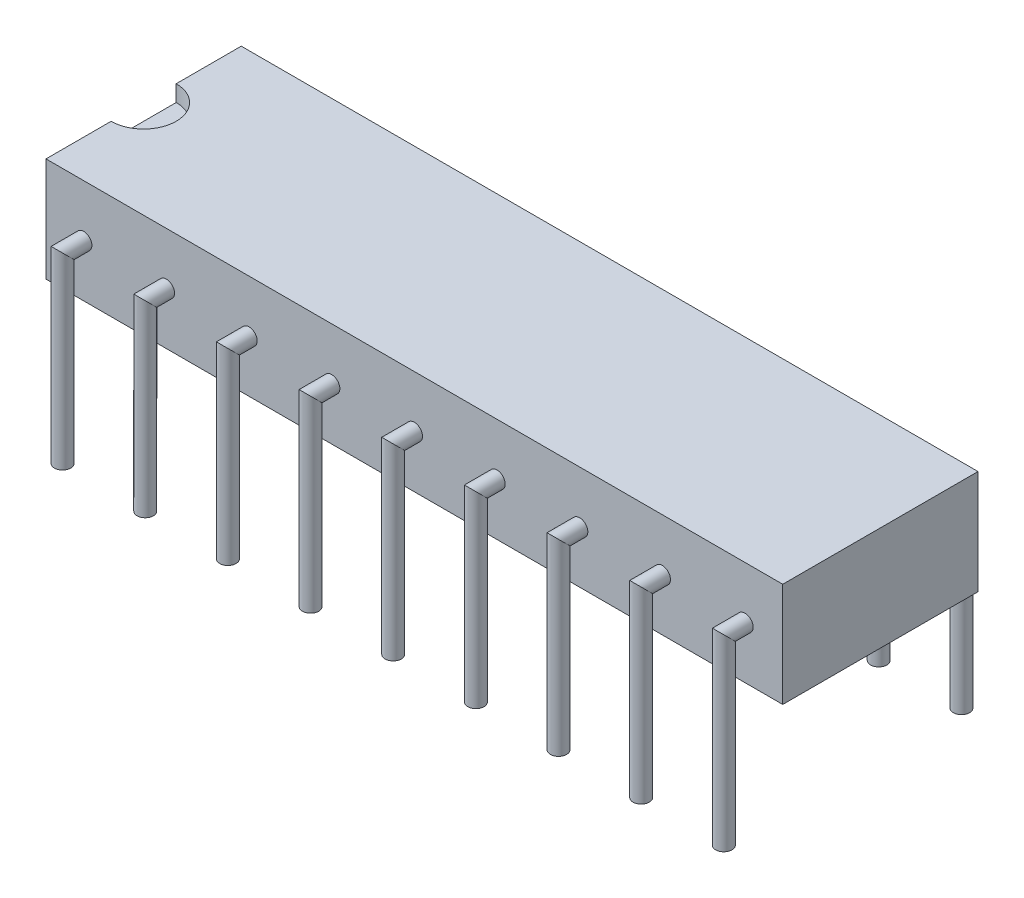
ISO-10303-21;
HEADER;
FILE_DESCRIPTION(('STEP AP214'),'2;1');
FILE_NAME('part.step','',(''),(''),'','','');
FILE_SCHEMA(('AUTOMOTIVE_DESIGN { 1 0 10303 214 1 1 1 1 }'));
ENDSEC;
DATA;
#1=APPLICATION_CONTEXT('core data for automotive mechanical design processes');
#2=APPLICATION_PROTOCOL_DEFINITION('international standard','automotive_design',2000,#1);
#3=PRODUCT_CONTEXT('',#1,'mechanical');
#4=PRODUCT('Part','Part','',(#3));
#5=PRODUCT_RELATED_PRODUCT_CATEGORY('part','',(#4));
#6=PRODUCT_DEFINITION_FORMATION('','',#4);
#7=PRODUCT_DEFINITION_CONTEXT('part definition',#1,'design');
#8=PRODUCT_DEFINITION('design','',#6,#7);
#9=PRODUCT_DEFINITION_SHAPE('','',#8);
#10=(LENGTH_UNIT() NAMED_UNIT(*) SI_UNIT(.MILLI.,.METRE.));
#11=(NAMED_UNIT(*) PLANE_ANGLE_UNIT() SI_UNIT($,.RADIAN.));
#12=(NAMED_UNIT(*) SI_UNIT($,.STERADIAN.) SOLID_ANGLE_UNIT());
#13=UNCERTAINTY_MEASURE_WITH_UNIT(LENGTH_MEASURE(1.E-05),#10,'distance_accuracy_value','');
#14=(GEOMETRIC_REPRESENTATION_CONTEXT(3) GLOBAL_UNCERTAINTY_ASSIGNED_CONTEXT((#13)) GLOBAL_UNIT_ASSIGNED_CONTEXT((#10,
#11,#12)) REPRESENTATION_CONTEXT('',''));
#15=CARTESIAN_POINT('',(0.,0.,0.));
#16=DIRECTION('',(0.,0.,1.));
#17=DIRECTION('',(1.,0.,0.));
#18=AXIS2_PLACEMENT_3D('',#15,#16,#17);
#19=CARTESIAN_POINT('',(22.64,3.2,3.));
#20=DIRECTION('',(0.,0.,-1.));
#21=DIRECTION('',(-1.,0.,0.));
#22=AXIS2_PLACEMENT_3D('',#19,#20,#21);
#23=PLANE('',#22);
#24=CARTESIAN_POINT('',(18.94,1.6,3.));
#25=DIRECTION('',(0.,0.,-1.));
#26=DIRECTION('',(-1.,0.,0.));
#27=AXIS2_PLACEMENT_3D('',#24,#25,#26);
#28=CIRCLE('',#27,0.25);
#29=CARTESIAN_POINT('',(18.69,1.6,3.));
#30=VERTEX_POINT('',#29);
#31=EDGE_CURVE('E62',#30,#30,#28,.F.);
#32=ORIENTED_EDGE('',*,*,#31,.F.);
#33=EDGE_LOOP('',(#32));
#34=FACE_BOUND('',#33,.T.);
#35=CARTESIAN_POINT('',(13.86,1.6,3.));
#36=DIRECTION('',(0.,0.,-1.));
#37=DIRECTION('',(-1.,0.,0.));
#38=AXIS2_PLACEMENT_3D('',#35,#36,#37);
#39=CIRCLE('',#38,0.25);
#40=CARTESIAN_POINT('',(13.61,1.6,3.));
#41=VERTEX_POINT('',#40);
#42=EDGE_CURVE('E168',#41,#41,#39,.F.);
#43=ORIENTED_EDGE('',*,*,#42,.F.);
#44=EDGE_LOOP('',(#43));
#45=FACE_BOUND('',#44,.T.);
#46=CARTESIAN_POINT('',(8.78,1.6,3.));
#47=DIRECTION('',(0.,0.,-1.));
#48=DIRECTION('',(-1.,0.,0.));
#49=AXIS2_PLACEMENT_3D('',#46,#47,#48);
#50=CIRCLE('',#49,0.25);
#51=CARTESIAN_POINT('',(8.53,1.6,3.));
#52=VERTEX_POINT('',#51);
#53=EDGE_CURVE('E162',#52,#52,#50,.F.);
#54=ORIENTED_EDGE('',*,*,#53,.F.);
#55=EDGE_LOOP('',(#54));
#56=FACE_BOUND('',#55,.T.);
#57=CARTESIAN_POINT('',(3.7,1.6,3.));
#58=DIRECTION('',(0.,0.,-1.));
#59=DIRECTION('',(-1.,0.,0.));
#60=AXIS2_PLACEMENT_3D('',#57,#58,#59);
#61=CIRCLE('',#60,0.25);
#62=CARTESIAN_POINT('',(3.45,1.6,3.));
#63=VERTEX_POINT('',#62);
#64=EDGE_CURVE('E156',#63,#63,#61,.F.);
#65=ORIENTED_EDGE('',*,*,#64,.F.);
#66=EDGE_LOOP('',(#65));
#67=FACE_BOUND('',#66,.T.);
#68=DIRECTION('',(0.,-1.,0.));
#69=VECTOR('',#68,1.);
#70=CARTESIAN_POINT('',(0.,3.2,3.));
#71=LINE('',#70,#69);
#72=CARTESIAN_POINT('',(0.,3.2,3.));
#73=VERTEX_POINT('',#72);
#74=CARTESIAN_POINT('',(0.,0.,3.));
#75=VERTEX_POINT('',#74);
#76=EDGE_CURVE('E192',#73,#75,#71,.T.);
#77=ORIENTED_EDGE('',*,*,#76,.T.);
#78=DIRECTION('',(-1.,0.,0.));
#79=VECTOR('',#78,1.);
#80=CARTESIAN_POINT('',(22.64,0.,3.));
#81=LINE('',#80,#79);
#82=CARTESIAN_POINT('',(22.64,0.,3.));
#83=VERTEX_POINT('',#82);
#84=EDGE_CURVE('E150',#83,#75,#81,.T.);
#85=ORIENTED_EDGE('',*,*,#84,.F.);
#86=DIRECTION('',(0.,-1.,0.));
#87=VECTOR('',#86,1.);
#88=CARTESIAN_POINT('',(22.64,3.2,3.));
#89=LINE('',#88,#87);
#90=CARTESIAN_POINT('',(22.64,3.2,3.));
#91=VERTEX_POINT('',#90);
#92=EDGE_CURVE('E130',#91,#83,#89,.T.);
#93=ORIENTED_EDGE('',*,*,#92,.F.);
#94=DIRECTION('',(-1.,0.,0.));
#95=VECTOR('',#94,1.);
#96=CARTESIAN_POINT('',(22.64,3.2,3.));
#97=LINE('',#96,#95);
#98=EDGE_CURVE('E143',#91,#73,#97,.T.);
#99=ORIENTED_EDGE('',*,*,#98,.T.);
#100=EDGE_LOOP('',(#77,#85,#93,#99));
#101=FACE_BOUND('',#100,.T.);
#102=CARTESIAN_POINT('',(1.16,1.6,3.));
#103=DIRECTION('',(0.,0.,-1.));
#104=DIRECTION('',(-1.,0.,0.));
#105=AXIS2_PLACEMENT_3D('',#102,#103,#104);
#106=CIRCLE('',#105,0.25);
#107=CARTESIAN_POINT('',(0.91,1.6,3.));
#108=VERTEX_POINT('',#107);
#109=EDGE_CURVE('E153',#108,#108,#106,.F.);
#110=ORIENTED_EDGE('',*,*,#109,.F.);
#111=EDGE_LOOP('',(#110));
#112=FACE_BOUND('',#111,.T.);
#113=CARTESIAN_POINT('',(6.24,1.6,3.));
#114=DIRECTION('',(0.,0.,-1.));
#115=DIRECTION('',(-1.,0.,0.));
#116=AXIS2_PLACEMENT_3D('',#113,#114,#115);
#117=CIRCLE('',#116,0.25);
#118=CARTESIAN_POINT('',(5.99,1.6,3.));
#119=VERTEX_POINT('',#118);
#120=EDGE_CURVE('E159',#119,#119,#117,.F.);
#121=ORIENTED_EDGE('',*,*,#120,.F.);
#122=EDGE_LOOP('',(#121));
#123=FACE_BOUND('',#122,.T.);
#124=CARTESIAN_POINT('',(11.32,1.6,3.));
#125=DIRECTION('',(0.,0.,-1.));
#126=DIRECTION('',(-1.,0.,0.));
#127=AXIS2_PLACEMENT_3D('',#124,#125,#126);
#128=CIRCLE('',#127,0.25);
#129=CARTESIAN_POINT('',(11.07,1.6,3.));
#130=VERTEX_POINT('',#129);
#131=EDGE_CURVE('E165',#130,#130,#128,.F.);
#132=ORIENTED_EDGE('',*,*,#131,.F.);
#133=EDGE_LOOP('',(#132));
#134=FACE_BOUND('',#133,.T.);
#135=CARTESIAN_POINT('',(16.4,1.6,3.));
#136=DIRECTION('',(0.,0.,-1.));
#137=DIRECTION('',(-1.,0.,0.));
#138=AXIS2_PLACEMENT_3D('',#135,#136,#137);
#139=CIRCLE('',#138,0.25);
#140=CARTESIAN_POINT('',(16.15,1.6,3.));
#141=VERTEX_POINT('',#140);
#142=EDGE_CURVE('E171',#141,#141,#139,.F.);
#143=ORIENTED_EDGE('',*,*,#142,.F.);
#144=EDGE_LOOP('',(#143));
#145=FACE_BOUND('',#144,.T.);
#146=CARTESIAN_POINT('',(21.48,1.6,3.));
#147=DIRECTION('',(0.,0.,-1.));
#148=DIRECTION('',(-1.,0.,0.));
#149=AXIS2_PLACEMENT_3D('',#146,#147,#148);
#150=CIRCLE('',#149,0.25);
#151=CARTESIAN_POINT('',(21.23,1.6,3.));
#152=VERTEX_POINT('',#151);
#153=EDGE_CURVE('E12',#152,#152,#150,.F.);
#154=ORIENTED_EDGE('',*,*,#153,.F.);
#155=EDGE_LOOP('',(#154));
#156=FACE_BOUND('',#155,.T.);
#157=ADVANCED_FACE('F55',(#34,#45,#56,#67,#101,#112,#123,#134,#145,#156),#23,.F.);
#158=CARTESIAN_POINT('',(22.64,0.,3.));
#159=DIRECTION('',(0.,1.,0.));
#160=DIRECTION('',(0.,0.,1.));
#161=AXIS2_PLACEMENT_3D('',#158,#159,#160);
#162=PLANE('',#161);
#163=DIRECTION('',(0.,0.,-1.));
#164=VECTOR('',#163,1.);
#165=CARTESIAN_POINT('',(0.,0.,3.));
#166=LINE('',#165,#164);
#167=CARTESIAN_POINT('',(0.,0.,-3.));
#168=VERTEX_POINT('',#167);
#169=EDGE_CURVE('E282',#75,#168,#166,.T.);
#170=ORIENTED_EDGE('',*,*,#169,.T.);
#171=DIRECTION('',(-1.,0.,0.));
#172=VECTOR('',#171,1.);
#173=CARTESIAN_POINT('',(22.64,0.,-3.));
#174=LINE('',#173,#172);
#175=CARTESIAN_POINT('',(22.64,0.,-3.));
#176=VERTEX_POINT('',#175);
#177=EDGE_CURVE('E147',#176,#168,#174,.T.);
#178=ORIENTED_EDGE('',*,*,#177,.F.);
#179=DIRECTION('',(0.,0.,-1.));
#180=VECTOR('',#179,1.);
#181=CARTESIAN_POINT('',(22.64,0.,3.));
#182=LINE('',#181,#180);
#183=EDGE_CURVE('E133',#83,#176,#182,.T.);
#184=ORIENTED_EDGE('',*,*,#183,.F.);
#185=ORIENTED_EDGE('',*,*,#84,.T.);
#186=EDGE_LOOP('',(#170,#178,#184,#185));
#187=FACE_BOUND('',#186,.T.);
#188=ADVANCED_FACE('F181',(#187),#162,.F.);
#189=CARTESIAN_POINT('',(22.64,3.2,-3.));
#190=DIRECTION('',(0.,0.,1.));
#191=DIRECTION('',(1.,0.,0.));
#192=AXIS2_PLACEMENT_3D('',#189,#190,#191);
#193=PLANE('',#192);
#194=CARTESIAN_POINT('',(21.48,1.6,-3.));
#195=DIRECTION('',(0.,0.,1.));
#196=DIRECTION('',(1.,0.,0.));
#197=AXIS2_PLACEMENT_3D('',#194,#195,#196);
#198=CIRCLE('',#197,0.25);
#199=CARTESIAN_POINT('',(21.73,1.6,-3.));
#200=VERTEX_POINT('',#199);
#201=EDGE_CURVE('E889',#200,#200,#198,.T.);
#202=ORIENTED_EDGE('',*,*,#201,.T.);
#203=EDGE_LOOP('',(#202));
#204=FACE_BOUND('',#203,.T.);
#205=CARTESIAN_POINT('',(18.94,1.6,-3.));
#206=DIRECTION('',(0.,0.,1.));
#207=DIRECTION('',(1.,0.,0.));
#208=AXIS2_PLACEMENT_3D('',#205,#206,#207);
#209=CIRCLE('',#208,0.25);
#210=CARTESIAN_POINT('',(19.19,1.6,-3.));
#211=VERTEX_POINT('',#210);
#212=EDGE_CURVE('E882',#211,#211,#209,.T.);
#213=ORIENTED_EDGE('',*,*,#212,.T.);
#214=EDGE_LOOP('',(#213));
#215=FACE_BOUND('',#214,.T.);
#216=CARTESIAN_POINT('',(16.4,1.6,-3.));
#217=DIRECTION('',(0.,0.,1.));
#218=DIRECTION('',(1.,0.,0.));
#219=AXIS2_PLACEMENT_3D('',#216,#217,#218);
#220=CIRCLE('',#219,0.25);
#221=CARTESIAN_POINT('',(16.65,1.6,-3.));
#222=VERTEX_POINT('',#221);
#223=EDGE_CURVE('E898',#222,#222,#220,.T.);
#224=ORIENTED_EDGE('',*,*,#223,.T.);
#225=EDGE_LOOP('',(#224));
#226=FACE_BOUND('',#225,.T.);
#227=CARTESIAN_POINT('',(13.86,1.6,-3.));
#228=DIRECTION('',(0.,0.,1.));
#229=DIRECTION('',(1.,0.,0.));
#230=AXIS2_PLACEMENT_3D('',#227,#228,#229);
#231=CIRCLE('',#230,0.25);
#232=CARTESIAN_POINT('',(14.11,1.6,-3.));
#233=VERTEX_POINT('',#232);
#234=EDGE_CURVE('E907',#233,#233,#231,.T.);
#235=ORIENTED_EDGE('',*,*,#234,.T.);
#236=EDGE_LOOP('',(#235));
#237=FACE_BOUND('',#236,.T.);
#238=CARTESIAN_POINT('',(11.32,1.6,-3.));
#239=DIRECTION('',(0.,0.,1.));
#240=DIRECTION('',(1.,0.,0.));
#241=AXIS2_PLACEMENT_3D('',#238,#239,#240);
#242=CIRCLE('',#241,0.25);
#243=CARTESIAN_POINT('',(11.57,1.6,-3.));
#244=VERTEX_POINT('',#243);
#245=EDGE_CURVE('E916',#244,#244,#242,.T.);
#246=ORIENTED_EDGE('',*,*,#245,.T.);
#247=EDGE_LOOP('',(#246));
#248=FACE_BOUND('',#247,.T.);
#249=CARTESIAN_POINT('',(8.78,1.6,-3.));
#250=DIRECTION('',(0.,0.,1.));
#251=DIRECTION('',(1.,0.,0.));
#252=AXIS2_PLACEMENT_3D('',#249,#250,#251);
#253=CIRCLE('',#252,0.25);
#254=CARTESIAN_POINT('',(9.03,1.6,-3.));
#255=VERTEX_POINT('',#254);
#256=EDGE_CURVE('E925',#255,#255,#253,.T.);
#257=ORIENTED_EDGE('',*,*,#256,.T.);
#258=EDGE_LOOP('',(#257));
#259=FACE_BOUND('',#258,.T.);
#260=CARTESIAN_POINT('',(6.24,1.6,-3.));
#261=DIRECTION('',(0.,0.,1.));
#262=DIRECTION('',(1.,0.,0.));
#263=AXIS2_PLACEMENT_3D('',#260,#261,#262);
#264=CIRCLE('',#263,0.25);
#265=CARTESIAN_POINT('',(6.49,1.6,-3.));
#266=VERTEX_POINT('',#265);
#267=EDGE_CURVE('E934',#266,#266,#264,.T.);
#268=ORIENTED_EDGE('',*,*,#267,.T.);
#269=EDGE_LOOP('',(#268));
#270=FACE_BOUND('',#269,.T.);
#271=CARTESIAN_POINT('',(3.7,1.6,-3.));
#272=DIRECTION('',(0.,0.,1.));
#273=DIRECTION('',(1.,0.,0.));
#274=AXIS2_PLACEMENT_3D('',#271,#272,#273);
#275=CIRCLE('',#274,0.25);
#276=CARTESIAN_POINT('',(3.95,1.6,-3.));
#277=VERTEX_POINT('',#276);
#278=EDGE_CURVE('E943',#277,#277,#275,.T.);
#279=ORIENTED_EDGE('',*,*,#278,.T.);
#280=EDGE_LOOP('',(#279));
#281=FACE_BOUND('',#280,.T.);
#282=CARTESIAN_POINT('',(1.16,1.6,-3.));
#283=DIRECTION('',(0.,0.,1.));
#284=DIRECTION('',(1.,0.,0.));
#285=AXIS2_PLACEMENT_3D('',#282,#283,#284);
#286=CIRCLE('',#285,0.25);
#287=CARTESIAN_POINT('',(1.41,1.6,-3.));
#288=VERTEX_POINT('',#287);
#289=EDGE_CURVE('E265',#288,#288,#286,.T.);
#290=ORIENTED_EDGE('',*,*,#289,.T.);
#291=EDGE_LOOP('',(#290));
#292=FACE_BOUND('',#291,.T.);
#293=DIRECTION('',(0.,1.,0.));
#294=VECTOR('',#293,1.);
#295=CARTESIAN_POINT('',(0.,3.2,-3.));
#296=LINE('',#295,#294);
#297=CARTESIAN_POINT('',(0.,3.2,-3.));
#298=VERTEX_POINT('',#297);
#299=EDGE_CURVE('E135',#168,#298,#296,.T.);
#300=ORIENTED_EDGE('',*,*,#299,.T.);
#301=DIRECTION('',(-1.,0.,0.));
#302=VECTOR('',#301,1.);
#303=CARTESIAN_POINT('',(22.64,3.2,-3.));
#304=LINE('',#303,#302);
#305=CARTESIAN_POINT('',(22.64,3.2,-3.));
#306=VERTEX_POINT('',#305);
#307=EDGE_CURVE('E129',#306,#298,#304,.T.);
#308=ORIENTED_EDGE('',*,*,#307,.F.);
#309=DIRECTION('',(0.,1.,0.));
#310=VECTOR('',#309,1.);
#311=CARTESIAN_POINT('',(22.64,3.2,-3.));
#312=LINE('',#311,#310);
#313=EDGE_CURVE('E140',#176,#306,#312,.T.);
#314=ORIENTED_EDGE('',*,*,#313,.F.);
#315=ORIENTED_EDGE('',*,*,#177,.T.);
#316=EDGE_LOOP('',(#300,#308,#314,#315));
#317=FACE_BOUND('',#316,.T.);
#318=ADVANCED_FACE('F286',(#204,#215,#226,#237,#248,#259,#270,#281,#292,#317),#193,.F.);
#319=CARTESIAN_POINT('',(22.64,3.2,3.));
#320=DIRECTION('',(0.,-1.,0.));
#321=DIRECTION('',(0.,0.,-1.));
#322=AXIS2_PLACEMENT_3D('',#319,#320,#321);
#323=PLANE('',#322);
#324=DIRECTION('',(0.,0.,1.));
#325=VECTOR('',#324,1.);
#326=CARTESIAN_POINT('',(0.,3.2,3.));
#327=LINE('',#326,#325);
#328=CARTESIAN_POINT('',(0.,3.2,-1.));
#329=VERTEX_POINT('',#328);
#330=EDGE_CURVE('E123',#298,#329,#327,.T.);
#331=ORIENTED_EDGE('',*,*,#330,.T.);
#332=CARTESIAN_POINT('',(0.,3.2,0.));
#333=DIRECTION('',(0.,1.,0.));
#334=DIRECTION('',(0.,0.,1.));
#335=AXIS2_PLACEMENT_3D('',#332,#333,#334);
#336=CIRCLE('',#335,1.);
#337=CARTESIAN_POINT('',(0.,3.2,1.));
#338=VERTEX_POINT('',#337);
#339=EDGE_CURVE('E107',#338,#329,#336,.T.);
#340=ORIENTED_EDGE('',*,*,#339,.F.);
#341=EDGE_CURVE('E131',#338,#73,#327,.T.);
#342=ORIENTED_EDGE('',*,*,#341,.T.);
#343=ORIENTED_EDGE('',*,*,#98,.F.);
#344=DIRECTION('',(0.,0.,1.));
#345=VECTOR('',#344,1.);
#346=CARTESIAN_POINT('',(22.64,3.2,3.));
#347=LINE('',#346,#345);
#348=EDGE_CURVE('E76',#306,#91,#347,.T.);
#349=ORIENTED_EDGE('',*,*,#348,.F.);
#350=ORIENTED_EDGE('',*,*,#307,.T.);
#351=EDGE_LOOP('',(#331,#340,#342,#343,#349,#350));
#352=FACE_BOUND('',#351,.T.);
#353=ADVANCED_FACE('F127',(#352),#323,.F.);
#354=CARTESIAN_POINT('',(22.64,0.,3.));
#355=DIRECTION('',(1.,0.,0.));
#356=DIRECTION('',(0.,0.,-1.));
#357=AXIS2_PLACEMENT_3D('',#354,#355,#356);
#358=PLANE('',#357);
#359=ORIENTED_EDGE('',*,*,#92,.T.);
#360=ORIENTED_EDGE('',*,*,#183,.T.);
#361=ORIENTED_EDGE('',*,*,#313,.T.);
#362=ORIENTED_EDGE('',*,*,#348,.T.);
#363=EDGE_LOOP('',(#359,#360,#361,#362));
#364=FACE_BOUND('',#363,.T.);
#365=ADVANCED_FACE('F289',(#364),#358,.T.);
#366=CARTESIAN_POINT('',(0.,0.,3.));
#367=DIRECTION('',(1.,0.,0.));
#368=DIRECTION('',(0.,0.,-1.));
#369=AXIS2_PLACEMENT_3D('',#366,#367,#368);
#370=PLANE('',#369);
#371=DIRECTION('',(0.,0.,1.));
#372=VECTOR('',#371,1.);
#373=CARTESIAN_POINT('',(0.,2.7,-1.));
#374=LINE('',#373,#372);
#375=CARTESIAN_POINT('',(0.,2.7,-1.));
#376=VERTEX_POINT('',#375);
#377=CARTESIAN_POINT('',(0.,2.7,1.));
#378=VERTEX_POINT('',#377);
#379=EDGE_CURVE('E124',#376,#378,#374,.T.);
#380=ORIENTED_EDGE('',*,*,#379,.F.);
#381=DIRECTION('',(0.,1.,0.));
#382=VECTOR('',#381,1.);
#383=CARTESIAN_POINT('',(0.,2.7,-1.));
#384=LINE('',#383,#382);
#385=EDGE_CURVE('E110',#376,#329,#384,.T.);
#386=ORIENTED_EDGE('',*,*,#385,.T.);
#387=ORIENTED_EDGE('',*,*,#330,.F.);
#388=ORIENTED_EDGE('',*,*,#299,.F.);
#389=ORIENTED_EDGE('',*,*,#169,.F.);
#390=ORIENTED_EDGE('',*,*,#76,.F.);
#391=ORIENTED_EDGE('',*,*,#341,.F.);
#392=DIRECTION('',(0.,1.,0.));
#393=VECTOR('',#392,1.);
#394=CARTESIAN_POINT('',(0.,2.7,1.));
#395=LINE('',#394,#393);
#396=EDGE_CURVE('E113',#378,#338,#395,.T.);
#397=ORIENTED_EDGE('',*,*,#396,.F.);
#398=EDGE_LOOP('',(#380,#386,#387,#388,#389,#390,#391,#397));
#399=FACE_BOUND('',#398,.T.);
#400=ADVANCED_FACE('F121',(#399),#370,.F.);
#401=CARTESIAN_POINT('',(0.,2.7,0.));
#402=DIRECTION('',(0.,1.,0.));
#403=DIRECTION('',(0.,0.,1.));
#404=AXIS2_PLACEMENT_3D('',#401,#402,#403);
#405=CYLINDRICAL_SURFACE('',#404,1.);
#406=ORIENTED_EDGE('',*,*,#339,.T.);
#407=ORIENTED_EDGE('',*,*,#385,.F.);
#408=CARTESIAN_POINT('',(0.,2.7,0.));
#409=DIRECTION('',(0.,1.,0.));
#410=DIRECTION('',(0.,0.,1.));
#411=AXIS2_PLACEMENT_3D('',#408,#409,#410);
#412=CIRCLE('',#411,1.);
#413=EDGE_CURVE('E68',#378,#376,#412,.T.);
#414=ORIENTED_EDGE('',*,*,#413,.F.);
#415=ORIENTED_EDGE('',*,*,#396,.T.);
#416=EDGE_LOOP('',(#406,#407,#414,#415));
#417=FACE_BOUND('',#416,.T.);
#418=ADVANCED_FACE('F109',(#417),#405,.F.);
#419=CARTESIAN_POINT('',(0.,2.7,0.));
#420=DIRECTION('',(0.,1.,0.));
#421=DIRECTION('',(0.,0.,1.));
#422=AXIS2_PLACEMENT_3D('',#419,#420,#421);
#423=PLANE('',#422);
#424=ORIENTED_EDGE('',*,*,#413,.T.);
#425=ORIENTED_EDGE('',*,*,#379,.T.);
#426=EDGE_LOOP('',(#424,#425));
#427=FACE_BOUND('',#426,.T.);
#428=ADVANCED_FACE('F333',(#427),#423,.T.);
#429=CARTESIAN_POINT('',(1.16,1.6,3.65));
#430=DIRECTION('',(0.,-1.,0.));
#431=DIRECTION('',(0.,0.,-1.));
#432=AXIS2_PLACEMENT_3D('',#429,#430,#431);
#433=CYLINDRICAL_SURFACE('',#432,0.25);
#434=CARTESIAN_POINT('',(1.16,1.6,3.65));
#435=DIRECTION('',(0.,-0.707106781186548,0.707106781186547));
#436=DIRECTION('',(0.,-0.707106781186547,-0.707106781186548));
#437=AXIS2_PLACEMENT_3D('',#434,#435,#436);
#438=ELLIPSE('',#437,0.353553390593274,0.25);
#439=CARTESIAN_POINT('',(1.16,1.35,3.4));
#440=VERTEX_POINT('',#439);
#441=EDGE_CURVE('E274',#440,#440,#438,.T.);
#442=ORIENTED_EDGE('',*,*,#441,.T.);
#443=EDGE_LOOP('',(#442));
#444=FACE_BOUND('',#443,.T.);
#445=CARTESIAN_POINT('',(1.16,-4.,3.65));
#446=DIRECTION('',(0.,-1.,0.));
#447=DIRECTION('',(0.,0.,-1.));
#448=AXIS2_PLACEMENT_3D('',#445,#446,#447);
#449=CIRCLE('',#448,0.25);
#450=CARTESIAN_POINT('',(1.16,-4.,3.4));
#451=VERTEX_POINT('',#450);
#452=EDGE_CURVE('E117',#451,#451,#449,.F.);
#453=ORIENTED_EDGE('',*,*,#452,.T.);
#454=EDGE_LOOP('',(#453));
#455=FACE_BOUND('',#454,.T.);
#456=ADVANCED_FACE('F341',(#444,#455),#433,.T.);
#457=CARTESIAN_POINT('',(1.16,1.6,4.35710678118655));
#458=DIRECTION('',(0.,0.,-1.));
#459=DIRECTION('',(0.,1.,0.));
#460=AXIS2_PLACEMENT_3D('',#457,#458,#459);
#461=CYLINDRICAL_SURFACE('',#460,0.25);
#462=ORIENTED_EDGE('',*,*,#109,.T.);
#463=EDGE_LOOP('',(#462));
#464=FACE_BOUND('',#463,.T.);
#465=ORIENTED_EDGE('',*,*,#441,.F.);
#466=EDGE_LOOP('',(#465));
#467=FACE_BOUND('',#466,.T.);
#468=ADVANCED_FACE('F350',(#464,#467),#461,.T.);
#469=CARTESIAN_POINT('',(1.16,-4.,3.65));
#470=DIRECTION('',(0.,-1.,0.));
#471=DIRECTION('',(0.,0.,-1.));
#472=AXIS2_PLACEMENT_3D('',#469,#470,#471);
#473=PLANE('',#472);
#474=ORIENTED_EDGE('',*,*,#452,.F.);
#475=EDGE_LOOP('',(#474));
#476=FACE_BOUND('',#475,.T.);
#477=ADVANCED_FACE('F360',(#476),#473,.T.);
#478=CARTESIAN_POINT('',(1.16,1.6,-3.65));
#479=DIRECTION('',(0.,-1.,0.));
#480=DIRECTION('',(0.,0.,-1.));
#481=AXIS2_PLACEMENT_3D('',#478,#479,#480);
#482=CYLINDRICAL_SURFACE('',#481,0.25);
#483=CARTESIAN_POINT('',(1.16,1.6,-3.65));
#484=DIRECTION('',(0.,-0.707106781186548,-0.707106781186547));
#485=DIRECTION('',(0.,-0.707106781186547,0.707106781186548));
#486=AXIS2_PLACEMENT_3D('',#483,#484,#485);
#487=ELLIPSE('',#486,0.353553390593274,0.25);
#488=CARTESIAN_POINT('',(1.16,1.35,-3.4));
#489=VERTEX_POINT('',#488);
#490=EDGE_CURVE('E268',#489,#489,#487,.F.);
#491=ORIENTED_EDGE('',*,*,#490,.F.);
#492=EDGE_LOOP('',(#491));
#493=FACE_BOUND('',#492,.T.);
#494=CARTESIAN_POINT('',(1.16,-4.,-3.65));
#495=DIRECTION('',(0.,-1.,0.));
#496=DIRECTION('',(0.,0.,-1.));
#497=AXIS2_PLACEMENT_3D('',#494,#495,#496);
#498=CIRCLE('',#497,0.25);
#499=CARTESIAN_POINT('',(1.16,-4.,-3.9));
#500=VERTEX_POINT('',#499);
#501=EDGE_CURVE('E271',#500,#500,#498,.T.);
#502=ORIENTED_EDGE('',*,*,#501,.F.);
#503=EDGE_LOOP('',(#502));
#504=FACE_BOUND('',#503,.T.);
#505=ADVANCED_FACE('F370',(#493,#504),#482,.T.);
#506=CARTESIAN_POINT('',(1.16,1.6,-4.35710678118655));
#507=DIRECTION('',(0.,0.,1.));
#508=DIRECTION('',(0.,-1.,0.));
#509=AXIS2_PLACEMENT_3D('',#506,#507,#508);
#510=CYLINDRICAL_SURFACE('',#509,0.25);
#511=ORIENTED_EDGE('',*,*,#289,.F.);
#512=EDGE_LOOP('',(#511));
#513=FACE_BOUND('',#512,.T.);
#514=ORIENTED_EDGE('',*,*,#490,.T.);
#515=EDGE_LOOP('',(#514));
#516=FACE_BOUND('',#515,.T.);
#517=ADVANCED_FACE('F380',(#513,#516),#510,.T.);
#518=CARTESIAN_POINT('',(1.16,-4.,-3.65));
#519=DIRECTION('',(0.,-1.,0.));
#520=DIRECTION('',(0.,0.,-1.));
#521=AXIS2_PLACEMENT_3D('',#518,#519,#520);
#522=PLANE('',#521);
#523=ORIENTED_EDGE('',*,*,#501,.T.);
#524=EDGE_LOOP('',(#523));
#525=FACE_BOUND('',#524,.T.);
#526=ADVANCED_FACE('F390',(#525),#522,.T.);
#527=CARTESIAN_POINT('',(3.7,1.6,3.65));
#528=DIRECTION('',(0.,-1.,0.));
#529=DIRECTION('',(0.,0.,-1.));
#530=AXIS2_PLACEMENT_3D('',#527,#528,#529);
#531=CYLINDRICAL_SURFACE('',#530,0.25);
#532=CARTESIAN_POINT('',(3.7,1.6,3.65));
#533=DIRECTION('',(0.,-0.707106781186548,0.707106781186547));
#534=DIRECTION('',(0.,-0.707106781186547,-0.707106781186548));
#535=AXIS2_PLACEMENT_3D('',#532,#533,#534);
#536=ELLIPSE('',#535,0.353553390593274,0.25);
#537=CARTESIAN_POINT('',(3.7,1.35,3.4));
#538=VERTEX_POINT('',#537);
#539=EDGE_CURVE('E259',#538,#538,#536,.T.);
#540=ORIENTED_EDGE('',*,*,#539,.T.);
#541=EDGE_LOOP('',(#540));
#542=FACE_BOUND('',#541,.T.);
#543=CARTESIAN_POINT('',(3.7,-4.,3.65));
#544=DIRECTION('',(0.,-1.,0.));
#545=DIRECTION('',(0.,0.,-1.));
#546=AXIS2_PLACEMENT_3D('',#543,#544,#545);
#547=CIRCLE('',#546,0.25);
#548=CARTESIAN_POINT('',(3.7,-4.,3.4));
#549=VERTEX_POINT('',#548);
#550=EDGE_CURVE('E262',#549,#549,#547,.F.);
#551=ORIENTED_EDGE('',*,*,#550,.T.);
#552=EDGE_LOOP('',(#551));
#553=FACE_BOUND('',#552,.T.);
#554=ADVANCED_FACE('F399',(#542,#553),#531,.T.);
#555=CARTESIAN_POINT('',(3.7,1.6,4.35710678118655));
#556=DIRECTION('',(0.,0.,-1.));
#557=DIRECTION('',(0.,1.,0.));
#558=AXIS2_PLACEMENT_3D('',#555,#556,#557);
#559=CYLINDRICAL_SURFACE('',#558,0.25);
#560=ORIENTED_EDGE('',*,*,#64,.T.);
#561=EDGE_LOOP('',(#560));
#562=FACE_BOUND('',#561,.T.);
#563=ORIENTED_EDGE('',*,*,#539,.F.);
#564=EDGE_LOOP('',(#563));
#565=FACE_BOUND('',#564,.T.);
#566=ADVANCED_FACE('F414',(#562,#565),#559,.T.);
#567=CARTESIAN_POINT('',(3.7,-4.,3.65));
#568=DIRECTION('',(0.,-1.,0.));
#569=DIRECTION('',(0.,0.,-1.));
#570=AXIS2_PLACEMENT_3D('',#567,#568,#569);
#571=PLANE('',#570);
#572=ORIENTED_EDGE('',*,*,#550,.F.);
#573=EDGE_LOOP('',(#572));
#574=FACE_BOUND('',#573,.T.);
#575=ADVANCED_FACE('F423',(#574),#571,.T.);
#576=CARTESIAN_POINT('',(6.24,1.6,3.65));
#577=DIRECTION('',(0.,-1.,0.));
#578=DIRECTION('',(0.,0.,-1.));
#579=AXIS2_PLACEMENT_3D('',#576,#577,#578);
#580=CYLINDRICAL_SURFACE('',#579,0.25);
#581=CARTESIAN_POINT('',(6.24,1.6,3.65));
#582=DIRECTION('',(0.,-0.707106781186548,0.707106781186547));
#583=DIRECTION('',(0.,-0.707106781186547,-0.707106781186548));
#584=AXIS2_PLACEMENT_3D('',#581,#582,#583);
#585=ELLIPSE('',#584,0.353553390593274,0.25);
#586=CARTESIAN_POINT('',(6.24,1.35,3.4));
#587=VERTEX_POINT('',#586);
#588=EDGE_CURVE('E253',#587,#587,#585,.T.);
#589=ORIENTED_EDGE('',*,*,#588,.T.);
#590=EDGE_LOOP('',(#589));
#591=FACE_BOUND('',#590,.T.);
#592=CARTESIAN_POINT('',(6.24,-4.,3.65));
#593=DIRECTION('',(0.,-1.,0.));
#594=DIRECTION('',(0.,0.,-1.));
#595=AXIS2_PLACEMENT_3D('',#592,#593,#594);
#596=CIRCLE('',#595,0.25);
#597=CARTESIAN_POINT('',(6.24,-4.,3.4));
#598=VERTEX_POINT('',#597);
#599=EDGE_CURVE('E256',#598,#598,#596,.F.);
#600=ORIENTED_EDGE('',*,*,#599,.T.);
#601=EDGE_LOOP('',(#600));
#602=FACE_BOUND('',#601,.T.);
#603=ADVANCED_FACE('F432',(#591,#602),#580,.T.);
#604=CARTESIAN_POINT('',(6.24,1.6,4.35710678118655));
#605=DIRECTION('',(0.,0.,-1.));
#606=DIRECTION('',(0.,1.,0.));
#607=AXIS2_PLACEMENT_3D('',#604,#605,#606);
#608=CYLINDRICAL_SURFACE('',#607,0.25);
#609=ORIENTED_EDGE('',*,*,#120,.T.);
#610=EDGE_LOOP('',(#609));
#611=FACE_BOUND('',#610,.T.);
#612=ORIENTED_EDGE('',*,*,#588,.F.);
#613=EDGE_LOOP('',(#612));
#614=FACE_BOUND('',#613,.T.);
#615=ADVANCED_FACE('F441',(#611,#614),#608,.T.);
#616=CARTESIAN_POINT('',(6.24,-4.,3.65));
#617=DIRECTION('',(0.,-1.,0.));
#618=DIRECTION('',(0.,0.,-1.));
#619=AXIS2_PLACEMENT_3D('',#616,#617,#618);
#620=PLANE('',#619);
#621=ORIENTED_EDGE('',*,*,#599,.F.);
#622=EDGE_LOOP('',(#621));
#623=FACE_BOUND('',#622,.T.);
#624=ADVANCED_FACE('F450',(#623),#620,.T.);
#625=CARTESIAN_POINT('',(8.78,1.6,3.65));
#626=DIRECTION('',(0.,-1.,0.));
#627=DIRECTION('',(0.,0.,-1.));
#628=AXIS2_PLACEMENT_3D('',#625,#626,#627);
#629=CYLINDRICAL_SURFACE('',#628,0.25);
#630=CARTESIAN_POINT('',(8.78,1.6,3.65));
#631=DIRECTION('',(0.,-0.707106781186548,0.707106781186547));
#632=DIRECTION('',(0.,-0.707106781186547,-0.707106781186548));
#633=AXIS2_PLACEMENT_3D('',#630,#631,#632);
#634=ELLIPSE('',#633,0.353553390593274,0.25);
#635=CARTESIAN_POINT('',(8.78,1.35,3.4));
#636=VERTEX_POINT('',#635);
#637=EDGE_CURVE('E247',#636,#636,#634,.T.);
#638=ORIENTED_EDGE('',*,*,#637,.T.);
#639=EDGE_LOOP('',(#638));
#640=FACE_BOUND('',#639,.T.);
#641=CARTESIAN_POINT('',(8.78,-4.,3.65));
#642=DIRECTION('',(0.,-1.,0.));
#643=DIRECTION('',(0.,0.,-1.));
#644=AXIS2_PLACEMENT_3D('',#641,#642,#643);
#645=CIRCLE('',#644,0.25);
#646=CARTESIAN_POINT('',(8.78,-4.,3.4));
#647=VERTEX_POINT('',#646);
#648=EDGE_CURVE('E250',#647,#647,#645,.F.);
#649=ORIENTED_EDGE('',*,*,#648,.T.);
#650=EDGE_LOOP('',(#649));
#651=FACE_BOUND('',#650,.T.);
#652=ADVANCED_FACE('F459',(#640,#651),#629,.T.);
#653=CARTESIAN_POINT('',(8.78,1.6,4.35710678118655));
#654=DIRECTION('',(0.,0.,-1.));
#655=DIRECTION('',(0.,1.,0.));
#656=AXIS2_PLACEMENT_3D('',#653,#654,#655);
#657=CYLINDRICAL_SURFACE('',#656,0.25);
#658=ORIENTED_EDGE('',*,*,#53,.T.);
#659=EDGE_LOOP('',(#658));
#660=FACE_BOUND('',#659,.T.);
#661=ORIENTED_EDGE('',*,*,#637,.F.);
#662=EDGE_LOOP('',(#661));
#663=FACE_BOUND('',#662,.T.);
#664=ADVANCED_FACE('F468',(#660,#663),#657,.T.);
#665=CARTESIAN_POINT('',(8.78,-4.,3.65));
#666=DIRECTION('',(0.,-1.,0.));
#667=DIRECTION('',(0.,0.,-1.));
#668=AXIS2_PLACEMENT_3D('',#665,#666,#667);
#669=PLANE('',#668);
#670=ORIENTED_EDGE('',*,*,#648,.F.);
#671=EDGE_LOOP('',(#670));
#672=FACE_BOUND('',#671,.T.);
#673=ADVANCED_FACE('F477',(#672),#669,.T.);
#674=CARTESIAN_POINT('',(11.32,1.6,3.65));
#675=DIRECTION('',(0.,-1.,0.));
#676=DIRECTION('',(0.,0.,-1.));
#677=AXIS2_PLACEMENT_3D('',#674,#675,#676);
#678=CYLINDRICAL_SURFACE('',#677,0.25);
#679=CARTESIAN_POINT('',(11.32,1.6,3.65));
#680=DIRECTION('',(0.,-0.707106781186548,0.707106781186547));
#681=DIRECTION('',(0.,-0.707106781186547,-0.707106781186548));
#682=AXIS2_PLACEMENT_3D('',#679,#680,#681);
#683=ELLIPSE('',#682,0.353553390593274,0.25);
#684=CARTESIAN_POINT('',(11.32,1.35,3.4));
#685=VERTEX_POINT('',#684);
#686=EDGE_CURVE('E241',#685,#685,#683,.T.);
#687=ORIENTED_EDGE('',*,*,#686,.T.);
#688=EDGE_LOOP('',(#687));
#689=FACE_BOUND('',#688,.T.);
#690=CARTESIAN_POINT('',(11.32,-4.,3.65));
#691=DIRECTION('',(0.,-1.,0.));
#692=DIRECTION('',(0.,0.,-1.));
#693=AXIS2_PLACEMENT_3D('',#690,#691,#692);
#694=CIRCLE('',#693,0.25);
#695=CARTESIAN_POINT('',(11.32,-4.,3.4));
#696=VERTEX_POINT('',#695);
#697=EDGE_CURVE('E244',#696,#696,#694,.F.);
#698=ORIENTED_EDGE('',*,*,#697,.T.);
#699=EDGE_LOOP('',(#698));
#700=FACE_BOUND('',#699,.T.);
#701=ADVANCED_FACE('F486',(#689,#700),#678,.T.);
#702=CARTESIAN_POINT('',(11.32,1.6,4.35710678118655));
#703=DIRECTION('',(0.,0.,-1.));
#704=DIRECTION('',(0.,1.,0.));
#705=AXIS2_PLACEMENT_3D('',#702,#703,#704);
#706=CYLINDRICAL_SURFACE('',#705,0.25);
#707=ORIENTED_EDGE('',*,*,#131,.T.);
#708=EDGE_LOOP('',(#707));
#709=FACE_BOUND('',#708,.T.);
#710=ORIENTED_EDGE('',*,*,#686,.F.);
#711=EDGE_LOOP('',(#710));
#712=FACE_BOUND('',#711,.T.);
#713=ADVANCED_FACE('F495',(#709,#712),#706,.T.);
#714=CARTESIAN_POINT('',(11.32,-4.,3.65));
#715=DIRECTION('',(0.,-1.,0.));
#716=DIRECTION('',(0.,0.,-1.));
#717=AXIS2_PLACEMENT_3D('',#714,#715,#716);
#718=PLANE('',#717);
#719=ORIENTED_EDGE('',*,*,#697,.F.);
#720=EDGE_LOOP('',(#719));
#721=FACE_BOUND('',#720,.T.);
#722=ADVANCED_FACE('F504',(#721),#718,.T.);
#723=CARTESIAN_POINT('',(13.86,1.6,3.65));
#724=DIRECTION('',(0.,-1.,0.));
#725=DIRECTION('',(0.,0.,-1.));
#726=AXIS2_PLACEMENT_3D('',#723,#724,#725);
#727=CYLINDRICAL_SURFACE('',#726,0.25);
#728=CARTESIAN_POINT('',(13.86,1.6,3.65));
#729=DIRECTION('',(0.,-0.707106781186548,0.707106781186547));
#730=DIRECTION('',(0.,-0.707106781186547,-0.707106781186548));
#731=AXIS2_PLACEMENT_3D('',#728,#729,#730);
#732=ELLIPSE('',#731,0.353553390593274,0.25);
#733=CARTESIAN_POINT('',(13.86,1.35,3.4));
#734=VERTEX_POINT('',#733);
#735=EDGE_CURVE('E235',#734,#734,#732,.T.);
#736=ORIENTED_EDGE('',*,*,#735,.T.);
#737=EDGE_LOOP('',(#736));
#738=FACE_BOUND('',#737,.T.);
#739=CARTESIAN_POINT('',(13.86,-4.,3.65));
#740=DIRECTION('',(0.,-1.,0.));
#741=DIRECTION('',(0.,0.,-1.));
#742=AXIS2_PLACEMENT_3D('',#739,#740,#741);
#743=CIRCLE('',#742,0.25);
#744=CARTESIAN_POINT('',(13.86,-4.,3.4));
#745=VERTEX_POINT('',#744);
#746=EDGE_CURVE('E238',#745,#745,#743,.F.);
#747=ORIENTED_EDGE('',*,*,#746,.T.);
#748=EDGE_LOOP('',(#747));
#749=FACE_BOUND('',#748,.T.);
#750=ADVANCED_FACE('F513',(#738,#749),#727,.T.);
#751=CARTESIAN_POINT('',(13.86,1.6,4.35710678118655));
#752=DIRECTION('',(0.,0.,-1.));
#753=DIRECTION('',(0.,1.,0.));
#754=AXIS2_PLACEMENT_3D('',#751,#752,#753);
#755=CYLINDRICAL_SURFACE('',#754,0.25);
#756=ORIENTED_EDGE('',*,*,#42,.T.);
#757=EDGE_LOOP('',(#756));
#758=FACE_BOUND('',#757,.T.);
#759=ORIENTED_EDGE('',*,*,#735,.F.);
#760=EDGE_LOOP('',(#759));
#761=FACE_BOUND('',#760,.T.);
#762=ADVANCED_FACE('F522',(#758,#761),#755,.T.);
#763=CARTESIAN_POINT('',(13.86,-4.,3.65));
#764=DIRECTION('',(0.,-1.,0.));
#765=DIRECTION('',(0.,0.,-1.));
#766=AXIS2_PLACEMENT_3D('',#763,#764,#765);
#767=PLANE('',#766);
#768=ORIENTED_EDGE('',*,*,#746,.F.);
#769=EDGE_LOOP('',(#768));
#770=FACE_BOUND('',#769,.T.);
#771=ADVANCED_FACE('F531',(#770),#767,.T.);
#772=CARTESIAN_POINT('',(16.4,1.6,3.65));
#773=DIRECTION('',(0.,-1.,0.));
#774=DIRECTION('',(0.,0.,-1.));
#775=AXIS2_PLACEMENT_3D('',#772,#773,#774);
#776=CYLINDRICAL_SURFACE('',#775,0.25);
#777=CARTESIAN_POINT('',(16.4,1.6,3.65));
#778=DIRECTION('',(0.,-0.707106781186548,0.707106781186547));
#779=DIRECTION('',(0.,-0.707106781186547,-0.707106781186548));
#780=AXIS2_PLACEMENT_3D('',#777,#778,#779);
#781=ELLIPSE('',#780,0.353553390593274,0.25);
#782=CARTESIAN_POINT('',(16.4,1.35,3.4));
#783=VERTEX_POINT('',#782);
#784=EDGE_CURVE('E229',#783,#783,#781,.T.);
#785=ORIENTED_EDGE('',*,*,#784,.T.);
#786=EDGE_LOOP('',(#785));
#787=FACE_BOUND('',#786,.T.);
#788=CARTESIAN_POINT('',(16.4,-4.,3.65));
#789=DIRECTION('',(0.,-1.,0.));
#790=DIRECTION('',(0.,0.,-1.));
#791=AXIS2_PLACEMENT_3D('',#788,#789,#790);
#792=CIRCLE('',#791,0.25);
#793=CARTESIAN_POINT('',(16.4,-4.,3.4));
#794=VERTEX_POINT('',#793);
#795=EDGE_CURVE('E232',#794,#794,#792,.F.);
#796=ORIENTED_EDGE('',*,*,#795,.T.);
#797=EDGE_LOOP('',(#796));
#798=FACE_BOUND('',#797,.T.);
#799=ADVANCED_FACE('F540',(#787,#798),#776,.T.);
#800=CARTESIAN_POINT('',(16.4,1.6,4.35710678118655));
#801=DIRECTION('',(0.,0.,-1.));
#802=DIRECTION('',(0.,1.,0.));
#803=AXIS2_PLACEMENT_3D('',#800,#801,#802);
#804=CYLINDRICAL_SURFACE('',#803,0.25);
#805=ORIENTED_EDGE('',*,*,#142,.T.);
#806=EDGE_LOOP('',(#805));
#807=FACE_BOUND('',#806,.T.);
#808=ORIENTED_EDGE('',*,*,#784,.F.);
#809=EDGE_LOOP('',(#808));
#810=FACE_BOUND('',#809,.T.);
#811=ADVANCED_FACE('F549',(#807,#810),#804,.T.);
#812=CARTESIAN_POINT('',(16.4,-4.,3.65));
#813=DIRECTION('',(0.,-1.,0.));
#814=DIRECTION('',(0.,0.,-1.));
#815=AXIS2_PLACEMENT_3D('',#812,#813,#814);
#816=PLANE('',#815);
#817=ORIENTED_EDGE('',*,*,#795,.F.);
#818=EDGE_LOOP('',(#817));
#819=FACE_BOUND('',#818,.T.);
#820=ADVANCED_FACE('F558',(#819),#816,.T.);
#821=CARTESIAN_POINT('',(18.94,1.6,3.65));
#822=DIRECTION('',(0.,-1.,0.));
#823=DIRECTION('',(0.,0.,-1.));
#824=AXIS2_PLACEMENT_3D('',#821,#822,#823);
#825=CYLINDRICAL_SURFACE('',#824,0.25);
#826=CARTESIAN_POINT('',(18.94,1.6,3.65));
#827=DIRECTION('',(0.,-0.707106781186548,0.707106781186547));
#828=DIRECTION('',(0.,-0.707106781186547,-0.707106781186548));
#829=AXIS2_PLACEMENT_3D('',#826,#827,#828);
#830=ELLIPSE('',#829,0.353553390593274,0.25);
#831=CARTESIAN_POINT('',(18.94,1.35,3.4));
#832=VERTEX_POINT('',#831);
#833=EDGE_CURVE('E217',#832,#832,#830,.T.);
#834=ORIENTED_EDGE('',*,*,#833,.T.);
#835=EDGE_LOOP('',(#834));
#836=FACE_BOUND('',#835,.T.);
#837=CARTESIAN_POINT('',(18.94,-4.,3.65));
#838=DIRECTION('',(0.,-1.,0.));
#839=DIRECTION('',(0.,0.,-1.));
#840=AXIS2_PLACEMENT_3D('',#837,#838,#839);
#841=CIRCLE('',#840,0.25);
#842=CARTESIAN_POINT('',(18.94,-4.,3.4));
#843=VERTEX_POINT('',#842);
#844=EDGE_CURVE('E226',#843,#843,#841,.F.);
#845=ORIENTED_EDGE('',*,*,#844,.T.);
#846=EDGE_LOOP('',(#845));
#847=FACE_BOUND('',#846,.T.);
#848=ADVANCED_FACE('F567',(#836,#847),#825,.T.);
#849=CARTESIAN_POINT('',(18.94,1.6,4.35710678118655));
#850=DIRECTION('',(0.,0.,-1.));
#851=DIRECTION('',(0.,1.,0.));
#852=AXIS2_PLACEMENT_3D('',#849,#850,#851);
#853=CYLINDRICAL_SURFACE('',#852,0.25);
#854=ORIENTED_EDGE('',*,*,#31,.T.);
#855=EDGE_LOOP('',(#854));
#856=FACE_BOUND('',#855,.T.);
#857=ORIENTED_EDGE('',*,*,#833,.F.);
#858=EDGE_LOOP('',(#857));
#859=FACE_BOUND('',#858,.T.);
#860=ADVANCED_FACE('F176',(#856,#859),#853,.T.);
#861=CARTESIAN_POINT('',(18.94,-4.,3.65));
#862=DIRECTION('',(0.,-1.,0.));
#863=DIRECTION('',(0.,0.,-1.));
#864=AXIS2_PLACEMENT_3D('',#861,#862,#863);
#865=PLANE('',#864);
#866=ORIENTED_EDGE('',*,*,#844,.F.);
#867=EDGE_LOOP('',(#866));
#868=FACE_BOUND('',#867,.T.);
#869=ADVANCED_FACE('F584',(#868),#865,.T.);
#870=CARTESIAN_POINT('',(21.48,1.6,3.65));
#871=DIRECTION('',(0.,-1.,0.));
#872=DIRECTION('',(0.,0.,-1.));
#873=AXIS2_PLACEMENT_3D('',#870,#871,#872);
#874=CYLINDRICAL_SURFACE('',#873,0.25);
#875=CARTESIAN_POINT('',(21.48,1.6,3.65));
#876=DIRECTION('',(0.,-0.707106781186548,0.707106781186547));
#877=DIRECTION('',(0.,-0.707106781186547,-0.707106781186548));
#878=AXIS2_PLACEMENT_3D('',#875,#876,#877);
#879=ELLIPSE('',#878,0.353553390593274,0.25);
#880=CARTESIAN_POINT('',(21.48,1.35,3.4));
#881=VERTEX_POINT('',#880);
#882=EDGE_CURVE('E211',#881,#881,#879,.T.);
#883=ORIENTED_EDGE('',*,*,#882,.T.);
#884=EDGE_LOOP('',(#883));
#885=FACE_BOUND('',#884,.T.);
#886=CARTESIAN_POINT('',(21.48,-4.,3.65));
#887=DIRECTION('',(0.,-1.,0.));
#888=DIRECTION('',(0.,0.,-1.));
#889=AXIS2_PLACEMENT_3D('',#886,#887,#888);
#890=CIRCLE('',#889,0.25);
#891=CARTESIAN_POINT('',(21.48,-4.,3.4));
#892=VERTEX_POINT('',#891);
#893=EDGE_CURVE('E213',#892,#892,#890,.F.);
#894=ORIENTED_EDGE('',*,*,#893,.T.);
#895=EDGE_LOOP('',(#894));
#896=FACE_BOUND('',#895,.T.);
#897=ADVANCED_FACE('F207',(#885,#896),#874,.T.);
#898=CARTESIAN_POINT('',(21.48,1.6,4.35710678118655));
#899=DIRECTION('',(0.,0.,-1.));
#900=DIRECTION('',(0.,1.,0.));
#901=AXIS2_PLACEMENT_3D('',#898,#899,#900);
#902=CYLINDRICAL_SURFACE('',#901,0.25);
#903=ORIENTED_EDGE('',*,*,#153,.T.);
#904=EDGE_LOOP('',(#903));
#905=FACE_BOUND('',#904,.T.);
#906=ORIENTED_EDGE('',*,*,#882,.F.);
#907=EDGE_LOOP('',(#906));
#908=FACE_BOUND('',#907,.T.);
#909=ADVANCED_FACE('F203',(#905,#908),#902,.T.);
#910=CARTESIAN_POINT('',(21.48,-4.,3.65));
#911=DIRECTION('',(0.,-1.,0.));
#912=DIRECTION('',(0.,0.,-1.));
#913=AXIS2_PLACEMENT_3D('',#910,#911,#912);
#914=PLANE('',#913);
#915=ORIENTED_EDGE('',*,*,#893,.F.);
#916=EDGE_LOOP('',(#915));
#917=FACE_BOUND('',#916,.T.);
#918=ADVANCED_FACE('F206',(#917),#914,.T.);
#919=CARTESIAN_POINT('',(3.7,1.6,-3.65));
#920=DIRECTION('',(0.,-1.,0.));
#921=DIRECTION('',(0.,0.,-1.));
#922=AXIS2_PLACEMENT_3D('',#919,#920,#921);
#923=CYLINDRICAL_SURFACE('',#922,0.25);
#924=CARTESIAN_POINT('',(3.7,1.6,-3.65));
#925=DIRECTION('',(0.,-0.707106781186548,-0.707106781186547));
#926=DIRECTION('',(0.,-0.707106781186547,0.707106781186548));
#927=AXIS2_PLACEMENT_3D('',#924,#925,#926);
#928=ELLIPSE('',#927,0.353553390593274,0.25);
#929=CARTESIAN_POINT('',(3.7,1.35,-3.4));
#930=VERTEX_POINT('',#929);
#931=EDGE_CURVE('E220',#930,#930,#928,.F.);
#932=ORIENTED_EDGE('',*,*,#931,.F.);
#933=EDGE_LOOP('',(#932));
#934=FACE_BOUND('',#933,.T.);
#935=CARTESIAN_POINT('',(3.7,-4.,-3.65));
#936=DIRECTION('',(0.,-1.,0.));
#937=DIRECTION('',(0.,0.,-1.));
#938=AXIS2_PLACEMENT_3D('',#935,#936,#937);
#939=CIRCLE('',#938,0.25);
#940=CARTESIAN_POINT('',(3.7,-4.,-3.9));
#941=VERTEX_POINT('',#940);
#942=EDGE_CURVE('E214',#941,#941,#939,.T.);
#943=ORIENTED_EDGE('',*,*,#942,.F.);
#944=EDGE_LOOP('',(#943));
#945=FACE_BOUND('',#944,.T.);
#946=ADVANCED_FACE('F612',(#934,#945),#923,.T.);
#947=CARTESIAN_POINT('',(3.7,1.6,-4.35710678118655));
#948=DIRECTION('',(0.,0.,1.));
#949=DIRECTION('',(0.,-1.,0.));
#950=AXIS2_PLACEMENT_3D('',#947,#948,#949);
#951=CYLINDRICAL_SURFACE('',#950,0.25);
#952=ORIENTED_EDGE('',*,*,#278,.F.);
#953=EDGE_LOOP('',(#952));
#954=FACE_BOUND('',#953,.T.);
#955=ORIENTED_EDGE('',*,*,#931,.T.);
#956=EDGE_LOOP('',(#955));
#957=FACE_BOUND('',#956,.T.);
#958=ADVANCED_FACE('F621',(#954,#957),#951,.T.);
#959=CARTESIAN_POINT('',(3.7,-4.,-3.65));
#960=DIRECTION('',(0.,-1.,0.));
#961=DIRECTION('',(0.,0.,-1.));
#962=AXIS2_PLACEMENT_3D('',#959,#960,#961);
#963=PLANE('',#962);
#964=ORIENTED_EDGE('',*,*,#942,.T.);
#965=EDGE_LOOP('',(#964));
#966=FACE_BOUND('',#965,.T.);
#967=ADVANCED_FACE('F630',(#966),#963,.T.);
#968=CARTESIAN_POINT('',(6.24,1.6,-3.65));
#969=DIRECTION('',(0.,-1.,0.));
#970=DIRECTION('',(0.,0.,-1.));
#971=AXIS2_PLACEMENT_3D('',#968,#969,#970);
#972=CYLINDRICAL_SURFACE('',#971,0.25);
#973=CARTESIAN_POINT('',(6.24,1.6,-3.65));
#974=DIRECTION('',(0.,-0.707106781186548,-0.707106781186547));
#975=DIRECTION('',(0.,-0.707106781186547,0.707106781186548));
#976=AXIS2_PLACEMENT_3D('',#973,#974,#975);
#977=ELLIPSE('',#976,0.353553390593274,0.25);
#978=CARTESIAN_POINT('',(6.24,1.35,-3.4));
#979=VERTEX_POINT('',#978);
#980=EDGE_CURVE('E937',#979,#979,#977,.F.);
#981=ORIENTED_EDGE('',*,*,#980,.F.);
#982=EDGE_LOOP('',(#981));
#983=FACE_BOUND('',#982,.T.);
#984=CARTESIAN_POINT('',(6.24,-4.,-3.65));
#985=DIRECTION('',(0.,-1.,0.));
#986=DIRECTION('',(0.,0.,-1.));
#987=AXIS2_PLACEMENT_3D('',#984,#985,#986);
#988=CIRCLE('',#987,0.25);
#989=CARTESIAN_POINT('',(6.24,-4.,-3.9));
#990=VERTEX_POINT('',#989);
#991=EDGE_CURVE('E940',#990,#990,#988,.T.);
#992=ORIENTED_EDGE('',*,*,#991,.F.);
#993=EDGE_LOOP('',(#992));
#994=FACE_BOUND('',#993,.T.);
#995=ADVANCED_FACE('F639',(#983,#994),#972,.T.);
#996=CARTESIAN_POINT('',(6.24,1.6,-4.35710678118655));
#997=DIRECTION('',(0.,0.,1.));
#998=DIRECTION('',(0.,-1.,0.));
#999=AXIS2_PLACEMENT_3D('',#996,#997,#998);
#1000=CYLINDRICAL_SURFACE('',#999,0.25);
#1001=ORIENTED_EDGE('',*,*,#267,.F.);
#1002=EDGE_LOOP('',(#1001));
#1003=FACE_BOUND('',#1002,.T.);
#1004=ORIENTED_EDGE('',*,*,#980,.T.);
#1005=EDGE_LOOP('',(#1004));
#1006=FACE_BOUND('',#1005,.T.);
#1007=ADVANCED_FACE('F648',(#1003,#1006),#1000,.T.);
#1008=CARTESIAN_POINT('',(6.24,-4.,-3.65));
#1009=DIRECTION('',(0.,-1.,0.));
#1010=DIRECTION('',(0.,0.,-1.));
#1011=AXIS2_PLACEMENT_3D('',#1008,#1009,#1010);
#1012=PLANE('',#1011);
#1013=ORIENTED_EDGE('',*,*,#991,.T.);
#1014=EDGE_LOOP('',(#1013));
#1015=FACE_BOUND('',#1014,.T.);
#1016=ADVANCED_FACE('F657',(#1015),#1012,.T.);
#1017=CARTESIAN_POINT('',(8.78,1.6,-3.65));
#1018=DIRECTION('',(0.,-1.,0.));
#1019=DIRECTION('',(0.,0.,-1.));
#1020=AXIS2_PLACEMENT_3D('',#1017,#1018,#1019);
#1021=CYLINDRICAL_SURFACE('',#1020,0.25);
#1022=CARTESIAN_POINT('',(8.78,1.6,-3.65));
#1023=DIRECTION('',(0.,-0.707106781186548,-0.707106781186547));
#1024=DIRECTION('',(0.,-0.707106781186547,0.707106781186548));
#1025=AXIS2_PLACEMENT_3D('',#1022,#1023,#1024);
#1026=ELLIPSE('',#1025,0.353553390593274,0.25);
#1027=CARTESIAN_POINT('',(8.78,1.35,-3.4));
#1028=VERTEX_POINT('',#1027);
#1029=EDGE_CURVE('E928',#1028,#1028,#1026,.F.);
#1030=ORIENTED_EDGE('',*,*,#1029,.F.);
#1031=EDGE_LOOP('',(#1030));
#1032=FACE_BOUND('',#1031,.T.);
#1033=CARTESIAN_POINT('',(8.78,-4.,-3.65));
#1034=DIRECTION('',(0.,-1.,0.));
#1035=DIRECTION('',(0.,0.,-1.));
#1036=AXIS2_PLACEMENT_3D('',#1033,#1034,#1035);
#1037=CIRCLE('',#1036,0.25);
#1038=CARTESIAN_POINT('',(8.78,-4.,-3.9));
#1039=VERTEX_POINT('',#1038);
#1040=EDGE_CURVE('E931',#1039,#1039,#1037,.T.);
#1041=ORIENTED_EDGE('',*,*,#1040,.F.);
#1042=EDGE_LOOP('',(#1041));
#1043=FACE_BOUND('',#1042,.T.);
#1044=ADVANCED_FACE('F666',(#1032,#1043),#1021,.T.);
#1045=CARTESIAN_POINT('',(8.78,1.6,-4.35710678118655));
#1046=DIRECTION('',(0.,0.,1.));
#1047=DIRECTION('',(0.,-1.,0.));
#1048=AXIS2_PLACEMENT_3D('',#1045,#1046,#1047);
#1049=CYLINDRICAL_SURFACE('',#1048,0.25);
#1050=ORIENTED_EDGE('',*,*,#256,.F.);
#1051=EDGE_LOOP('',(#1050));
#1052=FACE_BOUND('',#1051,.T.);
#1053=ORIENTED_EDGE('',*,*,#1029,.T.);
#1054=EDGE_LOOP('',(#1053));
#1055=FACE_BOUND('',#1054,.T.);
#1056=ADVANCED_FACE('F675',(#1052,#1055),#1049,.T.);
#1057=CARTESIAN_POINT('',(8.78,-4.,-3.65));
#1058=DIRECTION('',(0.,-1.,0.));
#1059=DIRECTION('',(0.,0.,-1.));
#1060=AXIS2_PLACEMENT_3D('',#1057,#1058,#1059);
#1061=PLANE('',#1060);
#1062=ORIENTED_EDGE('',*,*,#1040,.T.);
#1063=EDGE_LOOP('',(#1062));
#1064=FACE_BOUND('',#1063,.T.);
#1065=ADVANCED_FACE('F684',(#1064),#1061,.T.);
#1066=CARTESIAN_POINT('',(11.32,1.6,-3.65));
#1067=DIRECTION('',(0.,-1.,0.));
#1068=DIRECTION('',(0.,0.,-1.));
#1069=AXIS2_PLACEMENT_3D('',#1066,#1067,#1068);
#1070=CYLINDRICAL_SURFACE('',#1069,0.25);
#1071=CARTESIAN_POINT('',(11.32,1.6,-3.65));
#1072=DIRECTION('',(0.,-0.707106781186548,-0.707106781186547));
#1073=DIRECTION('',(0.,-0.707106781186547,0.707106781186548));
#1074=AXIS2_PLACEMENT_3D('',#1071,#1072,#1073);
#1075=ELLIPSE('',#1074,0.353553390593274,0.25);
#1076=CARTESIAN_POINT('',(11.32,1.35,-3.4));
#1077=VERTEX_POINT('',#1076);
#1078=EDGE_CURVE('E919',#1077,#1077,#1075,.F.);
#1079=ORIENTED_EDGE('',*,*,#1078,.F.);
#1080=EDGE_LOOP('',(#1079));
#1081=FACE_BOUND('',#1080,.T.);
#1082=CARTESIAN_POINT('',(11.32,-4.,-3.65));
#1083=DIRECTION('',(0.,-1.,0.));
#1084=DIRECTION('',(0.,0.,-1.));
#1085=AXIS2_PLACEMENT_3D('',#1082,#1083,#1084);
#1086=CIRCLE('',#1085,0.25);
#1087=CARTESIAN_POINT('',(11.32,-4.,-3.9));
#1088=VERTEX_POINT('',#1087);
#1089=EDGE_CURVE('E922',#1088,#1088,#1086,.T.);
#1090=ORIENTED_EDGE('',*,*,#1089,.F.);
#1091=EDGE_LOOP('',(#1090));
#1092=FACE_BOUND('',#1091,.T.);
#1093=ADVANCED_FACE('F693',(#1081,#1092),#1070,.T.);
#1094=CARTESIAN_POINT('',(11.32,1.6,-4.35710678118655));
#1095=DIRECTION('',(0.,0.,1.));
#1096=DIRECTION('',(0.,-1.,0.));
#1097=AXIS2_PLACEMENT_3D('',#1094,#1095,#1096);
#1098=CYLINDRICAL_SURFACE('',#1097,0.25);
#1099=ORIENTED_EDGE('',*,*,#245,.F.);
#1100=EDGE_LOOP('',(#1099));
#1101=FACE_BOUND('',#1100,.T.);
#1102=ORIENTED_EDGE('',*,*,#1078,.T.);
#1103=EDGE_LOOP('',(#1102));
#1104=FACE_BOUND('',#1103,.T.);
#1105=ADVANCED_FACE('F702',(#1101,#1104),#1098,.T.);
#1106=CARTESIAN_POINT('',(11.32,-4.,-3.65));
#1107=DIRECTION('',(0.,-1.,0.));
#1108=DIRECTION('',(0.,0.,-1.));
#1109=AXIS2_PLACEMENT_3D('',#1106,#1107,#1108);
#1110=PLANE('',#1109);
#1111=ORIENTED_EDGE('',*,*,#1089,.T.);
#1112=EDGE_LOOP('',(#1111));
#1113=FACE_BOUND('',#1112,.T.);
#1114=ADVANCED_FACE('F711',(#1113),#1110,.T.);
#1115=CARTESIAN_POINT('',(13.86,1.6,-3.65));
#1116=DIRECTION('',(0.,-1.,0.));
#1117=DIRECTION('',(0.,0.,-1.));
#1118=AXIS2_PLACEMENT_3D('',#1115,#1116,#1117);
#1119=CYLINDRICAL_SURFACE('',#1118,0.25);
#1120=CARTESIAN_POINT('',(13.86,1.6,-3.65));
#1121=DIRECTION('',(0.,-0.707106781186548,-0.707106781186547));
#1122=DIRECTION('',(0.,-0.707106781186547,0.707106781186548));
#1123=AXIS2_PLACEMENT_3D('',#1120,#1121,#1122);
#1124=ELLIPSE('',#1123,0.353553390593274,0.25);
#1125=CARTESIAN_POINT('',(13.86,1.35,-3.4));
#1126=VERTEX_POINT('',#1125);
#1127=EDGE_CURVE('E910',#1126,#1126,#1124,.F.);
#1128=ORIENTED_EDGE('',*,*,#1127,.F.);
#1129=EDGE_LOOP('',(#1128));
#1130=FACE_BOUND('',#1129,.T.);
#1131=CARTESIAN_POINT('',(13.86,-4.,-3.65));
#1132=DIRECTION('',(0.,-1.,0.));
#1133=DIRECTION('',(0.,0.,-1.));
#1134=AXIS2_PLACEMENT_3D('',#1131,#1132,#1133);
#1135=CIRCLE('',#1134,0.25);
#1136=CARTESIAN_POINT('',(13.86,-4.,-3.9));
#1137=VERTEX_POINT('',#1136);
#1138=EDGE_CURVE('E913',#1137,#1137,#1135,.T.);
#1139=ORIENTED_EDGE('',*,*,#1138,.F.);
#1140=EDGE_LOOP('',(#1139));
#1141=FACE_BOUND('',#1140,.T.);
#1142=ADVANCED_FACE('F720',(#1130,#1141),#1119,.T.);
#1143=CARTESIAN_POINT('',(13.86,1.6,-4.35710678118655));
#1144=DIRECTION('',(0.,0.,1.));
#1145=DIRECTION('',(0.,-1.,0.));
#1146=AXIS2_PLACEMENT_3D('',#1143,#1144,#1145);
#1147=CYLINDRICAL_SURFACE('',#1146,0.25);
#1148=ORIENTED_EDGE('',*,*,#234,.F.);
#1149=EDGE_LOOP('',(#1148));
#1150=FACE_BOUND('',#1149,.T.);
#1151=ORIENTED_EDGE('',*,*,#1127,.T.);
#1152=EDGE_LOOP('',(#1151));
#1153=FACE_BOUND('',#1152,.T.);
#1154=ADVANCED_FACE('F729',(#1150,#1153),#1147,.T.);
#1155=CARTESIAN_POINT('',(13.86,-4.,-3.65));
#1156=DIRECTION('',(0.,-1.,0.));
#1157=DIRECTION('',(0.,0.,-1.));
#1158=AXIS2_PLACEMENT_3D('',#1155,#1156,#1157);
#1159=PLANE('',#1158);
#1160=ORIENTED_EDGE('',*,*,#1138,.T.);
#1161=EDGE_LOOP('',(#1160));
#1162=FACE_BOUND('',#1161,.T.);
#1163=ADVANCED_FACE('F738',(#1162),#1159,.T.);
#1164=CARTESIAN_POINT('',(16.4,1.6,-3.65));
#1165=DIRECTION('',(0.,-1.,0.));
#1166=DIRECTION('',(0.,0.,-1.));
#1167=AXIS2_PLACEMENT_3D('',#1164,#1165,#1166);
#1168=CYLINDRICAL_SURFACE('',#1167,0.25);
#1169=CARTESIAN_POINT('',(16.4,1.6,-3.65));
#1170=DIRECTION('',(0.,-0.707106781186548,-0.707106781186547));
#1171=DIRECTION('',(0.,-0.707106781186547,0.707106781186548));
#1172=AXIS2_PLACEMENT_3D('',#1169,#1170,#1171);
#1173=ELLIPSE('',#1172,0.353553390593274,0.25);
#1174=CARTESIAN_POINT('',(16.4,1.35,-3.4));
#1175=VERTEX_POINT('',#1174);
#1176=EDGE_CURVE('E901',#1175,#1175,#1173,.F.);
#1177=ORIENTED_EDGE('',*,*,#1176,.F.);
#1178=EDGE_LOOP('',(#1177));
#1179=FACE_BOUND('',#1178,.T.);
#1180=CARTESIAN_POINT('',(16.4,-4.,-3.65));
#1181=DIRECTION('',(0.,-1.,0.));
#1182=DIRECTION('',(0.,0.,-1.));
#1183=AXIS2_PLACEMENT_3D('',#1180,#1181,#1182);
#1184=CIRCLE('',#1183,0.25);
#1185=CARTESIAN_POINT('',(16.4,-4.,-3.9));
#1186=VERTEX_POINT('',#1185);
#1187=EDGE_CURVE('E904',#1186,#1186,#1184,.T.);
#1188=ORIENTED_EDGE('',*,*,#1187,.F.);
#1189=EDGE_LOOP('',(#1188));
#1190=FACE_BOUND('',#1189,.T.);
#1191=ADVANCED_FACE('F747',(#1179,#1190),#1168,.T.);
#1192=CARTESIAN_POINT('',(16.4,1.6,-4.35710678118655));
#1193=DIRECTION('',(0.,0.,1.));
#1194=DIRECTION('',(0.,-1.,0.));
#1195=AXIS2_PLACEMENT_3D('',#1192,#1193,#1194);
#1196=CYLINDRICAL_SURFACE('',#1195,0.25);
#1197=ORIENTED_EDGE('',*,*,#223,.F.);
#1198=EDGE_LOOP('',(#1197));
#1199=FACE_BOUND('',#1198,.T.);
#1200=ORIENTED_EDGE('',*,*,#1176,.T.);
#1201=EDGE_LOOP('',(#1200));
#1202=FACE_BOUND('',#1201,.T.);
#1203=ADVANCED_FACE('F756',(#1199,#1202),#1196,.T.);
#1204=CARTESIAN_POINT('',(16.4,-4.,-3.65));
#1205=DIRECTION('',(0.,-1.,0.));
#1206=DIRECTION('',(0.,0.,-1.));
#1207=AXIS2_PLACEMENT_3D('',#1204,#1205,#1206);
#1208=PLANE('',#1207);
#1209=ORIENTED_EDGE('',*,*,#1187,.T.);
#1210=EDGE_LOOP('',(#1209));
#1211=FACE_BOUND('',#1210,.T.);
#1212=ADVANCED_FACE('F765',(#1211),#1208,.T.);
#1213=CARTESIAN_POINT('',(18.94,1.6,-3.65));
#1214=DIRECTION('',(0.,-1.,0.));
#1215=DIRECTION('',(0.,0.,-1.));
#1216=AXIS2_PLACEMENT_3D('',#1213,#1214,#1215);
#1217=CYLINDRICAL_SURFACE('',#1216,0.25);
#1218=CARTESIAN_POINT('',(18.94,1.6,-3.65));
#1219=DIRECTION('',(0.,-0.707106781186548,-0.707106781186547));
#1220=DIRECTION('',(0.,-0.707106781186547,0.707106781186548));
#1221=AXIS2_PLACEMENT_3D('',#1218,#1219,#1220);
#1222=ELLIPSE('',#1221,0.353553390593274,0.25);
#1223=CARTESIAN_POINT('',(18.94,1.35,-3.4));
#1224=VERTEX_POINT('',#1223);
#1225=EDGE_CURVE('E886',#1224,#1224,#1222,.F.);
#1226=ORIENTED_EDGE('',*,*,#1225,.F.);
#1227=EDGE_LOOP('',(#1226));
#1228=FACE_BOUND('',#1227,.T.);
#1229=CARTESIAN_POINT('',(18.94,-4.,-3.65));
#1230=DIRECTION('',(0.,-1.,0.));
#1231=DIRECTION('',(0.,0.,-1.));
#1232=AXIS2_PLACEMENT_3D('',#1229,#1230,#1231);
#1233=CIRCLE('',#1232,0.25);
#1234=CARTESIAN_POINT('',(18.94,-4.,-3.9));
#1235=VERTEX_POINT('',#1234);
#1236=EDGE_CURVE('E895',#1235,#1235,#1233,.T.);
#1237=ORIENTED_EDGE('',*,*,#1236,.F.);
#1238=EDGE_LOOP('',(#1237));
#1239=FACE_BOUND('',#1238,.T.);
#1240=ADVANCED_FACE('F774',(#1228,#1239),#1217,.T.);
#1241=CARTESIAN_POINT('',(18.94,1.6,-4.35710678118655));
#1242=DIRECTION('',(0.,0.,1.));
#1243=DIRECTION('',(0.,-1.,0.));
#1244=AXIS2_PLACEMENT_3D('',#1241,#1242,#1243);
#1245=CYLINDRICAL_SURFACE('',#1244,0.25);
#1246=ORIENTED_EDGE('',*,*,#212,.F.);
#1247=EDGE_LOOP('',(#1246));
#1248=FACE_BOUND('',#1247,.T.);
#1249=ORIENTED_EDGE('',*,*,#1225,.T.);
#1250=EDGE_LOOP('',(#1249));
#1251=FACE_BOUND('',#1250,.T.);
#1252=ADVANCED_FACE('F783',(#1248,#1251),#1245,.T.);
#1253=CARTESIAN_POINT('',(18.94,-4.,-3.65));
#1254=DIRECTION('',(0.,-1.,0.));
#1255=DIRECTION('',(0.,0.,-1.));
#1256=AXIS2_PLACEMENT_3D('',#1253,#1254,#1255);
#1257=PLANE('',#1256);
#1258=ORIENTED_EDGE('',*,*,#1236,.T.);
#1259=EDGE_LOOP('',(#1258));
#1260=FACE_BOUND('',#1259,.T.);
#1261=ADVANCED_FACE('F792',(#1260),#1257,.T.);
#1262=CARTESIAN_POINT('',(21.48,1.6,-3.65));
#1263=DIRECTION('',(0.,-1.,0.));
#1264=DIRECTION('',(0.,0.,-1.));
#1265=AXIS2_PLACEMENT_3D('',#1262,#1263,#1264);
#1266=CYLINDRICAL_SURFACE('',#1265,0.25);
#1267=CARTESIAN_POINT('',(21.48,1.6,-3.65));
#1268=DIRECTION('',(0.,-0.707106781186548,-0.707106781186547));
#1269=DIRECTION('',(0.,-0.707106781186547,0.707106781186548));
#1270=AXIS2_PLACEMENT_3D('',#1267,#1268,#1269);
#1271=ELLIPSE('',#1270,0.353553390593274,0.25);
#1272=CARTESIAN_POINT('',(21.48,1.35,-3.4));
#1273=VERTEX_POINT('',#1272);
#1274=EDGE_CURVE('E883',#1273,#1273,#1271,.F.);
#1275=ORIENTED_EDGE('',*,*,#1274,.F.);
#1276=EDGE_LOOP('',(#1275));
#1277=FACE_BOUND('',#1276,.T.);
#1278=CARTESIAN_POINT('',(21.48,-4.,-3.65));
#1279=DIRECTION('',(0.,-1.,0.));
#1280=DIRECTION('',(0.,0.,-1.));
#1281=AXIS2_PLACEMENT_3D('',#1278,#1279,#1280);
#1282=CIRCLE('',#1281,0.25);
#1283=CARTESIAN_POINT('',(21.48,-4.,-3.9));
#1284=VERTEX_POINT('',#1283);
#1285=EDGE_CURVE('E880',#1284,#1284,#1282,.T.);
#1286=ORIENTED_EDGE('',*,*,#1285,.F.);
#1287=EDGE_LOOP('',(#1286));
#1288=FACE_BOUND('',#1287,.T.);
#1289=ADVANCED_FACE('F801',(#1277,#1288),#1266,.T.);
#1290=CARTESIAN_POINT('',(21.48,1.6,-4.35710678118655));
#1291=DIRECTION('',(0.,0.,1.));
#1292=DIRECTION('',(0.,-1.,0.));
#1293=AXIS2_PLACEMENT_3D('',#1290,#1291,#1292);
#1294=CYLINDRICAL_SURFACE('',#1293,0.25);
#1295=ORIENTED_EDGE('',*,*,#201,.F.);
#1296=EDGE_LOOP('',(#1295));
#1297=FACE_BOUND('',#1296,.T.);
#1298=ORIENTED_EDGE('',*,*,#1274,.T.);
#1299=EDGE_LOOP('',(#1298));
#1300=FACE_BOUND('',#1299,.T.);
#1301=ADVANCED_FACE('F810',(#1297,#1300),#1294,.T.);
#1302=CARTESIAN_POINT('',(21.48,-4.,-3.65));
#1303=DIRECTION('',(0.,-1.,0.));
#1304=DIRECTION('',(0.,0.,-1.));
#1305=AXIS2_PLACEMENT_3D('',#1302,#1303,#1304);
#1306=PLANE('',#1305);
#1307=ORIENTED_EDGE('',*,*,#1285,.T.);
#1308=EDGE_LOOP('',(#1307));
#1309=FACE_BOUND('',#1308,.T.);
#1310=ADVANCED_FACE('F819',(#1309),#1306,.T.);
#1311=CLOSED_SHELL('',(#157,#188,#318,#353,#365,#400,#418,#428,#456,#468,#477,#505,#517,#526,
#554,#566,#575,#603,#615,#624,#652,#664,#673,#701,#713,#722,#750,#762,#771,#799,#811,#820,#848,
#860,#869,#897,#909,#918,#946,#958,#967,#995,#1007,#1016,#1044,#1056,#1065,#1093,#1105,#1114,
#1142,#1154,#1163,#1191,#1203,#1212,#1240,#1252,#1261,#1289,#1301,#1310));
#1312=MANIFOLD_SOLID_BREP('B2',#1311);
#1313=ADVANCED_BREP_SHAPE_REPRESENTATION('',(#18,#1312),#14);
#1314=SHAPE_DEFINITION_REPRESENTATION(#9,#1313);
ENDSEC;
END-ISO-10303-21;
